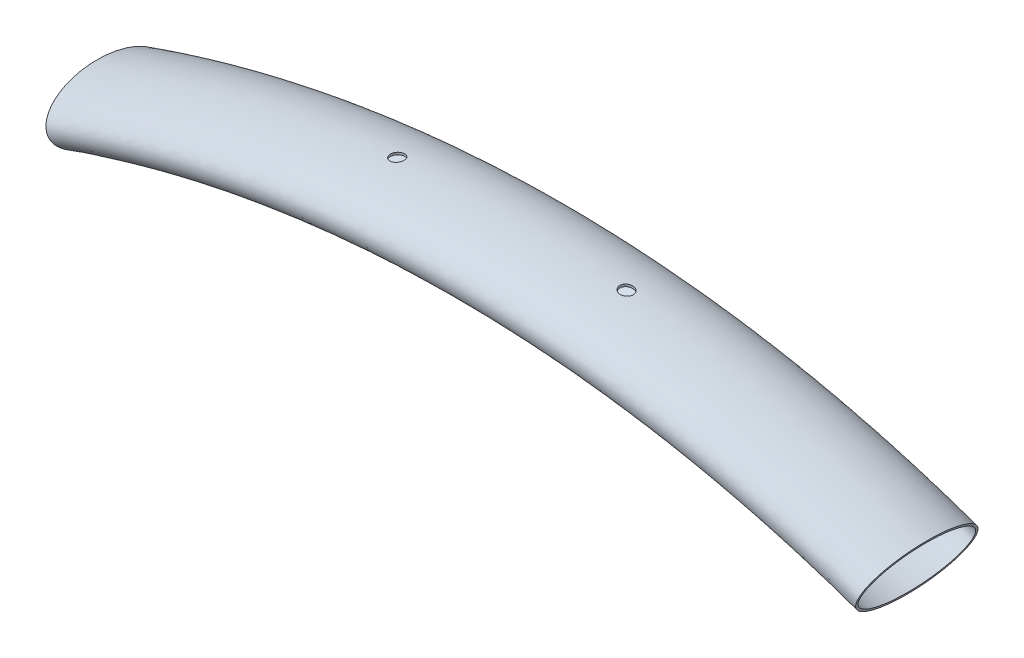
ISO-10303-21;
HEADER;
FILE_DESCRIPTION(('STEP AP214'),'2;1');
FILE_NAME('part.step','',(''),(''),'','','');
FILE_SCHEMA(('AUTOMOTIVE_DESIGN { 1 0 10303 214 1 1 1 1 }'));
ENDSEC;
DATA;
#1=APPLICATION_CONTEXT('core data for automotive mechanical design processes');
#2=APPLICATION_PROTOCOL_DEFINITION('international standard','automotive_design',2000,#1);
#3=PRODUCT_CONTEXT('',#1,'mechanical');
#4=PRODUCT('Part','Part','',(#3));
#5=PRODUCT_RELATED_PRODUCT_CATEGORY('part','',(#4));
#6=PRODUCT_DEFINITION_FORMATION('','',#4);
#7=PRODUCT_DEFINITION_CONTEXT('part definition',#1,'design');
#8=PRODUCT_DEFINITION('design','',#6,#7);
#9=PRODUCT_DEFINITION_SHAPE('','',#8);
#10=(LENGTH_UNIT() NAMED_UNIT(*) SI_UNIT(.MILLI.,.METRE.));
#11=(NAMED_UNIT(*) PLANE_ANGLE_UNIT() SI_UNIT($,.RADIAN.));
#12=(NAMED_UNIT(*) SI_UNIT($,.STERADIAN.) SOLID_ANGLE_UNIT());
#13=UNCERTAINTY_MEASURE_WITH_UNIT(LENGTH_MEASURE(1.E-05),#10,'distance_accuracy_value','');
#14=(GEOMETRIC_REPRESENTATION_CONTEXT(3) GLOBAL_UNCERTAINTY_ASSIGNED_CONTEXT((#13)) GLOBAL_UNIT_ASSIGNED_CONTEXT((#10,
#11,#12)) REPRESENTATION_CONTEXT('',''));
#15=CARTESIAN_POINT('',(0.,0.,0.));
#16=DIRECTION('',(0.,0.,1.));
#17=DIRECTION('',(1.,0.,0.));
#18=AXIS2_PLACEMENT_3D('',#15,#16,#17);
#19=CARTESIAN_POINT('',(16.6298249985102,1371.23970344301,-38.5));
#20=CARTESIAN_POINT('',(17.0007477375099,1370.18948603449,-38.5));
#21=CARTESIAN_POINT('',(17.7425932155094,1368.08905121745,-38.0679435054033));
#22=CARTESIAN_POINT('',(18.8672478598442,1364.90474418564,-36.0381168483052));
#23=CARTESIAN_POINT('',(19.948494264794,1361.84334169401,-32.5799915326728));
#24=CARTESIAN_POINT('',(21.2442337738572,1358.17463108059,-26.2099412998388));
#25=CARTESIAN_POINT('',(22.4502461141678,1354.75997077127,-15.4123334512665));
#26=CARTESIAN_POINT('',(22.9610834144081,1353.31360426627,0.));
#27=CARTESIAN_POINT('',(22.4502461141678,1354.75997077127,15.4123334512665));
#28=CARTESIAN_POINT('',(21.2442337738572,1358.17463108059,26.2099412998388));
#29=CARTESIAN_POINT('',(19.948494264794,1361.84334169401,32.5799915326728));
#30=CARTESIAN_POINT('',(18.8672478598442,1364.90474418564,36.0381168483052));
#31=CARTESIAN_POINT('',(17.7425932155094,1368.08905121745,38.0679435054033));
#32=CARTESIAN_POINT('',(16.6298249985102,1371.23970344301,38.7160282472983));
#33=CARTESIAN_POINT('',(15.5170567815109,1374.39035566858,38.0679435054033));
#34=CARTESIAN_POINT('',(14.3924021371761,1377.57466270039,36.0381168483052));
#35=CARTESIAN_POINT('',(13.3111557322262,1380.63606519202,32.5799915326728));
#36=CARTESIAN_POINT('',(12.015416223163,1384.30477580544,26.2099412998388));
#37=CARTESIAN_POINT('',(10.8094038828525,1387.71943611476,15.4123334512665));
#38=CARTESIAN_POINT('',(10.2985665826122,1389.16580261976,0.));
#39=CARTESIAN_POINT('',(10.8094038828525,1387.71943611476,-15.4123334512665));
#40=CARTESIAN_POINT('',(12.015416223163,1384.30477580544,-26.2099412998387));
#41=CARTESIAN_POINT('',(13.3111557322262,1380.63606519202,-32.5799915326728));
#42=CARTESIAN_POINT('',(14.3924021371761,1377.57466270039,-36.0381168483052));
#43=CARTESIAN_POINT('',(15.5170567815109,1374.39035566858,-38.0679435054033));
#44=CARTESIAN_POINT('',(16.2589022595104,1372.28992085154,-38.5));
#45=CARTESIAN_POINT('',(16.6298249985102,1371.23970344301,-38.5));
#46=B_SPLINE_CURVE_WITH_KNOTS('',3,(#19,#20,#21,#22,#23,#24,#25,#26,#27,#28,#29,#30,#31,#32,#33,
#34,#35,#36,#37,#38,#39,#40,#41,#42,#43,#44,#45),.UNSPECIFIED.,.T.,.F.,(4,1,1,1,1,1,1,1,1,1,1,1,
1,1,1,1,1,1,1,1,1,1,1,1,4),(0.,0.196349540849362,0.392699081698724,0.589048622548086,
0.785398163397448,1.17809724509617,1.5707963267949,1.96349540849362,2.35619449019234,
2.5525440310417,2.74889357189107,2.94524311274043,3.14159265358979,3.33794219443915,
3.53429173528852,3.73064127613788,3.92699081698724,4.31968989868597,4.71238898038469,
5.10508806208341,5.49778714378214,5.6941366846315,5.89048622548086,6.08683576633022,
6.28318530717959),.UNSPECIFIED.);
#47=CARTESIAN_POINT('',(283.383688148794,615.962333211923,0.));
#48=DIRECTION('',(0.,0.,-1.));
#49=AXIS1_PLACEMENT('',#47,#48);
#50=SURFACE_OF_REVOLUTION('',#46,#49);
#51=CARTESIAN_POINT('',(360.893181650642,1431.65807183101,-4.50000000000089));
#52=CARTESIAN_POINT('',(361.145822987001,1431.63406677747,-4.49998912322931));
#53=CARTESIAN_POINT('',(361.398744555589,1431.61116363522,-4.47865492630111));
#54=CARTESIAN_POINT('',(361.897842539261,1431.56814351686,-4.39373056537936));
#55=CARTESIAN_POINT('',(362.144011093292,1431.54802968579,-4.33009316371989));
#56=CARTESIAN_POINT('',(362.622306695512,1431.51091485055,-4.16224875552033));
#57=CARTESIAN_POINT('',(362.854437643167,1431.49391297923,-4.0580530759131));
#58=CARTESIAN_POINT('',(363.297956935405,1431.46308811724,-3.81200225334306));
#59=CARTESIAN_POINT('',(363.509350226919,1431.44926436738,-3.67015612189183));
#60=CARTESIAN_POINT('',(363.904787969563,1431.42469689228,-3.353244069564));
#61=CARTESIAN_POINT('',(364.088907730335,1431.41394460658,-3.17827278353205));
#62=CARTESIAN_POINT('',(364.425207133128,1431.39521204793,-2.79980039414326));
#63=CARTESIAN_POINT('',(364.577385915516,1431.38723184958,-2.59629852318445));
#64=CARTESIAN_POINT('',(364.845171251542,1431.37374146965,-2.16695073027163));
#65=CARTESIAN_POINT('',(364.960843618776,1431.3682268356,-1.94114599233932));
#66=CARTESIAN_POINT('',(365.152679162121,1431.35934402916,-1.47329612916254));
#67=CARTESIAN_POINT('',(365.228842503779,1431.35597584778,-1.23125107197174));
#68=CARTESIAN_POINT('',(365.339465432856,1431.35115530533,-0.737872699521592));
#69=CARTESIAN_POINT('',(365.373937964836,1431.34970234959,-0.486542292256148));
#70=CARTESIAN_POINT('',(365.400238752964,1431.34858942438,0.0183436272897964));
#71=CARTESIAN_POINT('',(365.392067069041,1431.3489294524,0.271899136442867));
#72=CARTESIAN_POINT('',(365.333311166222,1431.35143330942,0.774051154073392));
#73=CARTESIAN_POINT('',(365.282724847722,1431.35359722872,1.02264741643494));
#74=CARTESIAN_POINT('',(365.140581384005,1431.35991614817,1.50781041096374));
#75=CARTESIAN_POINT('',(365.049024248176,1431.36407114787,1.74437714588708));
#76=CARTESIAN_POINT('',(364.827561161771,1431.37463633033,2.19875691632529));
#77=CARTESIAN_POINT('',(364.697656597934,1431.38104643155,2.41657062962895));
#78=CARTESIAN_POINT('',(364.403218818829,1431.3964356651,2.82727457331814));
#79=CARTESIAN_POINT('',(364.238685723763,1431.40541478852,3.02016489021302));
#80=CARTESIAN_POINT('',(363.879697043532,1431.42624177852,3.37557818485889));
#81=CARTESIAN_POINT('',(363.685239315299,1431.4380898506,3.53809898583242));
#82=CARTESIAN_POINT('',(363.271989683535,1431.46486818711,3.8281855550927));
#83=CARTESIAN_POINT('',(363.0531977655,1431.47979845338,3.95575130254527));
#84=CARTESIAN_POINT('',(362.597299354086,1431.51281976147,4.17250004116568));
#85=CARTESIAN_POINT('',(362.360173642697,1431.53091414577,4.2616420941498));
#86=CARTESIAN_POINT('',(361.87457587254,1431.57010503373,4.398923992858));
#87=CARTESIAN_POINT('',(361.626103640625,1431.59120158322,4.44706321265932));
#88=CARTESIAN_POINT('',(361.124034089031,1431.6360776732,4.50118463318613));
#89=CARTESIAN_POINT('',(360.870422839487,1431.6598656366,4.50703054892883));
#90=CARTESIAN_POINT('',(360.366000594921,1431.7094189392,4.47615185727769));
#91=CARTESIAN_POINT('',(360.115189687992,1431.73518434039,4.43942591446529));
#92=CARTESIAN_POINT('',(359.622183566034,1431.78793226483,4.32422864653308));
#93=CARTESIAN_POINT('',(359.380035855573,1431.81492006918,4.24555639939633));
#94=CARTESIAN_POINT('',(358.912430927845,1431.86889876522,4.04857930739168));
#95=CARTESIAN_POINT('',(358.686974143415,1431.89588965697,3.93027343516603));
#96=CARTESIAN_POINT('',(358.2584919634,1431.94871769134,3.65693387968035));
#97=CARTESIAN_POINT('',(358.055530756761,1431.97455141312,3.50179887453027));
#98=CARTESIAN_POINT('',(357.678565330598,1432.02369153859,3.15928674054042));
#99=CARTESIAN_POINT('',(357.504560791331,1432.04699797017,2.97190996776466));
#100=CARTESIAN_POINT('',(357.191108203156,1432.0897589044,2.57083799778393));
#101=CARTESIAN_POINT('',(357.051544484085,1432.10922625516,2.35723460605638));
#102=CARTESIAN_POINT('',(356.810347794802,1432.14330669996,1.90923454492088));
#103=CARTESIAN_POINT('',(356.708712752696,1432.15792005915,1.67483901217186));
#104=CARTESIAN_POINT('',(356.547180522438,1432.18132314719,1.19414796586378));
#105=CARTESIAN_POINT('',(356.486918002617,1432.19016381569,0.947977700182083));
#106=CARTESIAN_POINT('',(356.408507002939,1432.20169448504,0.448881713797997));
#107=CARTESIAN_POINT('',(356.390356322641,1432.20438480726,0.195956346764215));
#108=CARTESIAN_POINT('',(356.396696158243,1432.2034483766,-0.307350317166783));
#109=CARTESIAN_POINT('',(356.420852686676,1432.19987110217,-0.557735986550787));
#110=CARTESIAN_POINT('',(356.510429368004,1432.18671803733,-1.05084603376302));
#111=CARTESIAN_POINT('',(356.575849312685,1432.1771422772,-1.29357045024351));
#112=CARTESIAN_POINT('',(356.745997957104,1432.15255843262,-1.76452836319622));
#113=CARTESIAN_POINT('',(356.850727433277,1432.13755024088,-1.9927615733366));
#114=CARTESIAN_POINT('',(357.096424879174,1432.10295677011,-2.42841146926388));
#115=CARTESIAN_POINT('',(357.237392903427,1432.0833714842,-2.63582812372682));
#116=CARTESIAN_POINT('',(357.552753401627,1432.04052298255,-3.02570448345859));
#117=CARTESIAN_POINT('',(357.727394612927,1432.01723263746,-3.20795996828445));
#118=CARTESIAN_POINT('',(358.104499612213,1431.96828928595,-3.54069160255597));
#119=CARTESIAN_POINT('',(358.306971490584,1431.94263559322,-3.69115847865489));
#120=CARTESIAN_POINT('',(358.736058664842,1431.88997020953,-3.95742287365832));
#121=CARTESIAN_POINT('',(358.962883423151,1431.86294800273,-4.07288045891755));
#122=CARTESIAN_POINT('',(359.432558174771,1431.80901456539,-4.26388451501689));
#123=CARTESIAN_POINT('',(359.675389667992,1431.78210324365,-4.33947618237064));
#124=CARTESIAN_POINT('',(360.081901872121,1431.73886101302,-4.42927261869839));
#125=CARTESIAN_POINT('',(360.242937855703,1431.72217840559,-4.45575470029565));
#126=CARTESIAN_POINT('',(360.567004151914,1431.68953463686,-4.4911219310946));
#127=CARTESIAN_POINT('',(360.730034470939,1431.67357347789,-4.50000702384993));
#128=CARTESIAN_POINT('',(360.893181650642,1431.65807183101,-4.50000000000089));
#129=B_SPLINE_CURVE_WITH_KNOTS('',3,(#51,#52,#53,#54,#55,#56,#57,#58,#59,#60,#61,#62,#63,#64,
#65,#66,#67,#68,#69,#70,#71,#72,#73,#74,#75,#76,#77,#78,#79,#80,#81,#82,#83,#84,#85,#86,#87,#88,
#89,#90,#91,#92,#93,#94,#95,#96,#97,#98,#99,#100,#101,#102,#103,#104,#105,#106,#107,#108,#109,
#110,#111,#112,#113,#114,#115,#116,#117,#118,#119,#120,#121,#122,#123,#124,#125,#126,#127,#128),
.UNSPECIFIED.,.T.,.F.,(4,2,2,2,2,2,2,2,2,2,2,2,2,2,2,2,2,2,2,2,2,2,2,2,2,2,2,2,2,2,2,2,2,2,2,2,
2,2,4),(0.,0.760743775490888,1.52233846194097,2.28372060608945,3.04492068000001,
3.80397804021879,4.56305582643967,5.32075722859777,6.07845545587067,6.83591836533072,
7.59338021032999,8.35087955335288,9.10837872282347,9.86585050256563,10.6233196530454,
11.3808430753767,12.1383669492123,12.896695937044,13.6550365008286,14.4158196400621,
15.1766266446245,15.9411110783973,16.7056153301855,17.4722477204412,18.2388716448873,
19.0028846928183,19.7668559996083,20.5239913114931,21.2810870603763,22.0322329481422,
22.783375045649,23.5345319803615,24.2856900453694,25.0426254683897,25.7997814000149,
26.564069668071,27.3274895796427,27.8187504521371,28.3100129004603),.UNSPECIFIED.);
#130=CARTESIAN_POINT('',(360.893181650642,1431.65807183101,-4.50000000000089));
#131=VERTEX_POINT('',#130);
#132=EDGE_CURVE('E46',#131,#131,#129,.T.);
#133=ORIENTED_EDGE('',*,*,#132,.F.);
#134=EDGE_LOOP('',(#133));
#135=FACE_BOUND('',#134,.T.);
#136=CARTESIAN_POINT('',(360.893181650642,1394.74533901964,-4.50000000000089));
#137=CARTESIAN_POINT('',(360.640762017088,1394.77045955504,-4.49998921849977));
#138=CARTESIAN_POINT('',(360.388036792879,1394.79423934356,-4.47869267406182));
#139=CARTESIAN_POINT('',(359.889271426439,1394.83852671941,-4.39389167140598));
#140=CARTESIAN_POINT('',(359.643238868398,1394.85903071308,-4.33034124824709));
#141=CARTESIAN_POINT('',(359.165151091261,1394.89648555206,-4.16269559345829));
#142=CARTESIAN_POINT('',(358.933092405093,1394.91343728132,-4.0586104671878));
#143=CARTESIAN_POINT('',(358.489672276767,1394.94381212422,-3.81279392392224));
#144=CARTESIAN_POINT('',(358.278306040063,1394.95723605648,-3.67107125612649));
#145=CARTESIAN_POINT('',(357.882940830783,1394.98077669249,-3.35445831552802));
#146=CARTESIAN_POINT('',(357.698859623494,1394.99090344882,-3.17967147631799));
#147=CARTESIAN_POINT('',(357.362587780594,1395.00830152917,-2.80159144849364));
#148=CARTESIAN_POINT('',(357.210398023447,1395.01557277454,-2.59829747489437));
#149=CARTESIAN_POINT('',(356.942484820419,1395.02770254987,-2.16929900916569));
#150=CARTESIAN_POINT('',(356.826709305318,1395.03256453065,-1.94362712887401));
#151=CARTESIAN_POINT('',(356.634636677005,1395.04031149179,-1.47603464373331));
#152=CARTESIAN_POINT('',(356.558339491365,1395.0431964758,-1.23411406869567));
#153=CARTESIAN_POINT('',(356.447393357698,1395.04730501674,-0.740861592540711));
#154=CARTESIAN_POINT('',(356.412749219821,1395.0485283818,-0.489528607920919));
#155=CARTESIAN_POINT('',(356.386112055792,1395.04947416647,0.0153900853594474));
#156=CARTESIAN_POINT('',(356.394119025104,1395.04919658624,0.268975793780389));
#157=CARTESIAN_POINT('',(356.452562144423,1395.04710086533,0.771256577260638));
#158=CARTESIAN_POINT('',(356.503007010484,1395.04528240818,1.01995063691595));
#159=CARTESIAN_POINT('',(356.644899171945,1395.03988053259,1.50533322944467));
#160=CARTESIAN_POINT('',(356.736346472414,1395.03629711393,1.74202176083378));
#161=CARTESIAN_POINT('',(356.957620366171,1395.02700342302,2.19664800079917));
#162=CARTESIAN_POINT('',(357.087443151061,1395.0212933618,2.41458756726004));
#163=CARTESIAN_POINT('',(357.381753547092,1395.00730526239,2.82555297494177));
#164=CARTESIAN_POINT('',(357.546240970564,1394.9990272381,3.01857895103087));
#165=CARTESIAN_POINT('',(357.905112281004,1394.97946617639,3.37420195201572));
#166=CARTESIAN_POINT('',(358.099488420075,1394.96818391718,3.53680683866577));
#167=CARTESIAN_POINT('',(358.512581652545,1394.94226406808,3.82707050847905));
#168=CARTESIAN_POINT('',(358.731298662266,1394.92762648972,3.95472941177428));
#169=CARTESIAN_POINT('',(359.186930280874,1394.8948123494,4.17161888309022));
#170=CARTESIAN_POINT('',(359.423855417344,1394.87663373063,4.26082701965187));
#171=CARTESIAN_POINT('',(359.909020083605,1394.83681496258,4.39829519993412));
#172=CARTESIAN_POINT('',(360.15725977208,1394.81517476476,4.44655466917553));
#173=CARTESIAN_POINT('',(360.658836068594,1394.76872061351,4.50099145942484));
#174=CARTESIAN_POINT('',(360.912186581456,1394.74389660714,4.5070319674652));
#175=CARTESIAN_POINT('',(361.416072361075,1394.6918034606,4.4766392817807));
#176=CARTESIAN_POINT('',(361.666607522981,1394.66453422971,4.44020451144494));
#177=CARTESIAN_POINT('',(362.159331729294,1394.60834764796,4.32564582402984));
#178=CARTESIAN_POINT('',(362.401463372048,1394.57942158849,4.24727926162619));
#179=CARTESIAN_POINT('',(362.869070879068,1394.52128784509,4.05094662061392));
#180=CARTESIAN_POINT('',(363.09454615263,1394.49208015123,3.93297913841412));
#181=CARTESIAN_POINT('',(363.523415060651,1394.43465449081,3.66015346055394));
#182=CARTESIAN_POINT('',(363.726714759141,1394.40644105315,3.50514658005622));
#183=CARTESIAN_POINT('',(364.104371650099,1394.35261165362,3.16278582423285));
#184=CARTESIAN_POINT('',(364.278729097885,1394.32699566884,2.97543223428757));
#185=CARTESIAN_POINT('',(364.592883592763,1394.27988896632,2.574274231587));
#186=CARTESIAN_POINT('',(364.732796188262,1394.25838451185,2.36056196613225));
#187=CARTESIAN_POINT('',(364.974645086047,1394.2206771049,1.91220338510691));
#188=CARTESIAN_POINT('',(365.076583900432,1394.20447380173,1.6775584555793));
#189=CARTESIAN_POINT('',(365.23848070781,1394.17852293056,1.1966825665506));
#190=CARTESIAN_POINT('',(365.298877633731,1394.16870792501,0.950603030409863));
#191=CARTESIAN_POINT('',(365.377577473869,1394.15588500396,0.451633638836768));
#192=CARTESIAN_POINT('',(365.395883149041,1394.15287664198,0.198744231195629));
#193=CARTESIAN_POINT('',(365.38986466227,1394.15386202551,-0.304026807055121));
#194=CARTESIAN_POINT('',(365.365955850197,1394.15778754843,-0.553913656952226));
#195=CARTESIAN_POINT('',(365.277047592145,1394.17225185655,-1.04606303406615));
#196=CARTESIAN_POINT('',(365.212048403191,1394.18279060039,-1.28832560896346));
#197=CARTESIAN_POINT('',(365.042925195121,1394.20982503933,-1.75841685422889));
#198=CARTESIAN_POINT('',(364.938801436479,1394.22632069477,-1.98624562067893));
#199=CARTESIAN_POINT('',(364.694497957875,1394.2642812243,-2.42120193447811));
#200=CARTESIAN_POINT('',(364.554317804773,1394.28574615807,-2.62832923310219));
#201=CARTESIAN_POINT('',(364.240404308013,1394.33264692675,-3.01816635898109));
#202=CARTESIAN_POINT('',(364.066362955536,1394.35811876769,-3.20062377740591));
#203=CARTESIAN_POINT('',(363.690468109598,1394.41149853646,-3.53387803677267));
#204=CARTESIAN_POINT('',(363.488606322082,1394.43940718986,-3.68466540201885));
#205=CARTESIAN_POINT('',(363.060314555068,1394.49655560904,-3.95196040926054));
#206=CARTESIAN_POINT('',(362.833633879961,1394.52580681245,-4.06806359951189));
#207=CARTESIAN_POINT('',(362.364095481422,1394.58393512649,-4.26035652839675));
#208=CARTESIAN_POINT('',(362.121256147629,1394.61281261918,-4.33659079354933));
#209=CARTESIAN_POINT('',(361.713059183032,1394.65913995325,-4.4277526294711));
#210=CARTESIAN_POINT('',(361.550359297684,1394.67704926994,-4.45480128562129));
#211=CARTESIAN_POINT('',(361.222876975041,1394.71194282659,-4.49092851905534));
#212=CARTESIAN_POINT('',(361.058094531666,1394.72892706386,-4.5000070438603));
#213=CARTESIAN_POINT('',(360.893181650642,1394.74533901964,-4.50000000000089));
#214=B_SPLINE_CURVE_WITH_KNOTS('',3,(#136,#137,#138,#139,#140,#141,#142,#143,#144,#145,#146,
#147,#148,#149,#150,#151,#152,#153,#154,#155,#156,#157,#158,#159,#160,#161,#162,#163,#164,#165,
#166,#167,#168,#169,#170,#171,#172,#173,#174,#175,#176,#177,#178,#179,#180,#181,#182,#183,#184,
#185,#186,#187,#188,#189,#190,#191,#192,#193,#194,#195,#196,#197,#198,#199,#200,#201,#202,#203,
#204,#205,#206,#207,#208,#209,#210,#211,#212,#213),.UNSPECIFIED.,.T.,.F.,(4,2,2,2,2,2,2,2,2,2,2,
2,2,2,2,2,2,2,2,2,2,2,2,2,2,2,2,2,2,2,2,2,2,2,2,2,2,2,4),(0.,0.760400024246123,1.52162858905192,
2.2826674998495,3.04352965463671,3.80204985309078,4.56059094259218,5.31804240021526,
6.07549246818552,6.83302999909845,7.59056744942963,8.34826052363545,9.1059536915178,
9.86357169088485,10.6211855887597,11.3786034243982,12.1360186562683,12.8938751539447,
13.6517422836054,14.4120641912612,15.1724143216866,15.9372126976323,16.7020381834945,
17.469987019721,18.2379290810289,19.0032587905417,19.768537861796,20.5256013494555,
21.282615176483,22.0322221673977,22.7818244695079,23.5314217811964,24.2810280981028,
25.0378019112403,25.7948018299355,26.5603123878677,27.3249661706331,27.8217555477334,
28.3185463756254),.UNSPECIFIED.);
#215=CARTESIAN_POINT('',(360.893181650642,1394.74533901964,-4.50000000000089));
#216=VERTEX_POINT('',#215);
#217=EDGE_CURVE('E84',#216,#216,#214,.T.);
#218=ORIENTED_EDGE('',*,*,#217,.F.);
#219=EDGE_LOOP('',(#218));
#220=FACE_BOUND('',#219,.T.);
#221=CARTESIAN_POINT('',(208.893181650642,1431.93930839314,-4.49999999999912));
#222=CARTESIAN_POINT('',(209.147299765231,1431.96250845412,-4.49998879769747));
#223=CARTESIAN_POINT('',(209.401498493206,1431.98685739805,-4.47840326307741));
#224=CARTESIAN_POINT('',(209.902686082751,1432.03705431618,-4.39268566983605));
#225=CARTESIAN_POINT('',(210.149665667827,1432.06290410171,-4.32850118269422));
#226=CARTESIAN_POINT('',(210.629107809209,1432.11505488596,-4.15945978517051));
#227=CARTESIAN_POINT('',(210.861578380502,1432.14135562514,-4.0546255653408));
#228=CARTESIAN_POINT('',(211.30551850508,1432.19323963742,-3.80725546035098));
#229=CARTESIAN_POINT('',(211.516993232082,1432.21882308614,-3.66472889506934));
#230=CARTESIAN_POINT('',(211.913182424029,1432.26804328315,-3.34579049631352));
#231=CARTESIAN_POINT('',(212.097875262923,1432.29167845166,-3.16935154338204));
#232=CARTESIAN_POINT('',(212.43497337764,1432.33572499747,-2.78757178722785));
#233=CARTESIAN_POINT('',(212.587378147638,1432.35613632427,-2.58223053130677));
#234=CARTESIAN_POINT('',(212.854700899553,1432.39248728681,-2.14957865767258));
#235=CARTESIAN_POINT('',(212.969810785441,1432.40844975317,-1.92238856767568));
#236=CARTESIAN_POINT('',(213.160185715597,1432.43510659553,-1.45159795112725));
#237=CARTESIAN_POINT('',(213.23545310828,1432.44580128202,-1.20799839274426));
#238=CARTESIAN_POINT('',(213.34336420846,1432.46120150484,-0.713656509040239));
#239=CARTESIAN_POINT('',(213.376385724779,1432.46596011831,-0.462998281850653));
#240=CARTESIAN_POINT('',(213.400047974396,1432.46936546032,0.0403468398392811));
#241=CARTESIAN_POINT('',(213.390690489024,1432.46801244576,0.29303364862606));
#242=CARTESIAN_POINT('',(213.33005455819,1432.45930673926,0.791781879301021));
#243=CARTESIAN_POINT('',(213.279009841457,1432.45198749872,1.03787235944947));
#244=CARTESIAN_POINT('',(213.136826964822,1432.43183666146,1.51794199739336));
#245=CARTESIAN_POINT('',(213.045688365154,1432.41900500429,1.7519210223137));
#246=CARTESIAN_POINT('',(212.825685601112,1432.3885348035,2.20188765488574));
#247=CARTESIAN_POINT('',(212.696715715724,1432.37088279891,2.41782263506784));
#248=CARTESIAN_POINT('',(212.404873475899,1432.33178021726,2.8250267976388));
#249=CARTESIAN_POINT('',(212.241999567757,1432.31032946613,3.01629484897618));
#250=CARTESIAN_POINT('',(211.885411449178,1432.26457628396,3.37049765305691));
#251=CARTESIAN_POINT('',(211.691443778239,1432.24025089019,3.53317427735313));
#252=CARTESIAN_POINT('',(211.279149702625,1432.19013395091,3.8237107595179));
#253=CARTESIAN_POINT('',(211.060822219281,1432.16434234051,3.95156907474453));
#254=CARTESIAN_POINT('',(210.604223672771,1432.11231151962,4.16975006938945));
#255=CARTESIAN_POINT('',(210.365819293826,1432.08607041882,4.25979342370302));
#256=CARTESIAN_POINT('',(209.877159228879,1432.03444637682,4.39844205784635));
#257=CARTESIAN_POINT('',(209.626903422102,1432.00906344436,4.44704691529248));
#258=CARTESIAN_POINT('',(209.121315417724,1431.96006516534,4.50140736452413));
#259=CARTESIAN_POINT('',(208.865977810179,1431.9364518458,4.50711453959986));
#260=CARTESIAN_POINT('',(208.357788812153,1431.89173070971,4.47528408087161));
#261=CARTESIAN_POINT('',(208.104937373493,1431.87062284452,4.4377472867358));
#262=CARTESIAN_POINT('',(207.609943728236,1431.83143152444,4.32061799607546));
#263=CARTESIAN_POINT('',(207.367764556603,1431.81333690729,4.24118547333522));
#264=CARTESIAN_POINT('',(206.900083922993,1431.78026005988,4.04253672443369));
#265=CARTESIAN_POINT('',(206.674582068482,1431.76527775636,3.92332143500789));
#266=CARTESIAN_POINT('',(206.247716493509,1431.73844422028,3.64905437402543));
#267=CARTESIAN_POINT('',(206.046252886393,1431.72657976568,3.49415933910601));
#268=CARTESIAN_POINT('',(205.672144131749,1431.70569077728,3.15262824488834));
#269=CARTESIAN_POINT('',(205.499498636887,1431.69666620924,2.96599256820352));
#270=CARTESIAN_POINT('',(205.188346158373,1431.68116778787,2.56673147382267));
#271=CARTESIAN_POINT('',(205.049764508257,1431.67468833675,2.35416445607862));
#272=CARTESIAN_POINT('',(204.810214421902,1431.66391970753,1.90874896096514));
#273=CARTESIAN_POINT('',(204.709245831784,1431.65963052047,1.67590056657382));
#274=CARTESIAN_POINT('',(204.54784695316,1431.65295137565,1.19664960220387));
#275=CARTESIAN_POINT('',(204.487397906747,1431.65056053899,0.950253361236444));
#276=CARTESIAN_POINT('',(204.408687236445,1431.64747534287,0.450801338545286));
#277=CARTESIAN_POINT('',(204.390425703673,1431.64678098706,0.197745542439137));
#278=CARTESIAN_POINT('',(204.396611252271,1431.64701930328,-0.307860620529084));
#279=CARTESIAN_POINT('',(204.421061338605,1431.64795208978,-0.560410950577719));
#280=CARTESIAN_POINT('',(204.511978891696,1431.65153635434,-1.05781975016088));
#281=CARTESIAN_POINT('',(204.578446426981,1431.65418783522,-1.30267820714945));
#282=CARTESIAN_POINT('',(204.751503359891,1431.66142471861,-1.77775528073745));
#283=CARTESIAN_POINT('',(204.85809346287,1431.66601015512,-2.00797363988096));
#284=CARTESIAN_POINT('',(205.108343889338,1431.67741660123,-2.44722087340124));
#285=CARTESIAN_POINT('',(205.252002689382,1431.68423751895,-2.65625061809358));
#286=CARTESIAN_POINT('',(205.572247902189,1431.70044516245,-3.04716823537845));
#287=CARTESIAN_POINT('',(205.748828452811,1431.70983143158,-3.22906092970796));
#288=CARTESIAN_POINT('',(206.129927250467,1431.73146773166,-3.56064984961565));
#289=CARTESIAN_POINT('',(206.334452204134,1431.74371845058,-3.71033832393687));
#290=CARTESIAN_POINT('',(206.765712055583,1431.77127744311,-3.97338073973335));
#291=CARTESIAN_POINT('',(206.992467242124,1431.7865885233,-4.0867010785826));
#292=CARTESIAN_POINT('',(207.461380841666,1431.8202641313,-4.27358256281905));
#293=CARTESIAN_POINT('',(207.703520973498,1431.83862507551,-4.34718994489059));
#294=CARTESIAN_POINT('',(208.104831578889,1431.87083204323,-4.43324945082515));
#295=CARTESIAN_POINT('',(208.261490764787,1431.88382921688,-4.45825637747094));
#296=CARTESIAN_POINT('',(208.576483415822,1431.91083832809,-4.49163513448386));
#297=CARTESIAN_POINT('',(208.734816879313,1431.92485026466,-4.50000698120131));
#298=CARTESIAN_POINT('',(208.893181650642,1431.93930839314,-4.49999999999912));
#299=B_SPLINE_CURVE_WITH_KNOTS('',3,(#221,#222,#223,#224,#225,#226,#227,#228,#229,#230,#231,
#232,#233,#234,#235,#236,#237,#238,#239,#240,#241,#242,#243,#244,#245,#246,#247,#248,#249,#250,
#251,#252,#253,#254,#255,#256,#257,#258,#259,#260,#261,#262,#263,#264,#265,#266,#267,#268,#269,
#270,#271,#272,#273,#274,#275,#276,#277,#278,#279,#280,#281,#282,#283,#284,#285,#286,#287,#288,
#289,#290,#291,#292,#293,#294,#295,#296,#297,#298),.UNSPECIFIED.,.T.,.F.,(4,2,2,2,2,2,2,2,2,2,2,
2,2,2,2,2,2,2,2,2,2,2,2,2,2,2,2,2,2,2,2,2,2,2,2,2,2,2,4),(0.,0.764942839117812,1.53082887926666,
2.29628801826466,3.06155806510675,3.8274426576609,4.59333924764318,5.35522984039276,
6.11707552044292,6.87205919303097,7.62701113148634,8.37775908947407,9.12851528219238,
9.88138981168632,10.6342988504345,11.3936904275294,12.1531156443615,12.9180557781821,
13.6830037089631,14.4488148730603,15.2146111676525,15.9775043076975,16.7403794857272,
17.4999652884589,18.2595419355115,19.017438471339,19.7753319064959,20.5328742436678,
21.2904182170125,22.0480154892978,22.80561399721,23.5632258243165,24.3208065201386,
25.0782524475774,25.8358804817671,26.5942065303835,27.3516477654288,27.8283556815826,
28.3050631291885),.UNSPECIFIED.);
#300=CARTESIAN_POINT('',(208.893181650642,1431.93930839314,-4.49999999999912));
#301=VERTEX_POINT('',#300);
#302=EDGE_CURVE('E70',#301,#301,#299,.T.);
#303=ORIENTED_EDGE('',*,*,#302,.F.);
#304=EDGE_LOOP('',(#303));
#305=FACE_BOUND('',#304,.T.);
#306=CARTESIAN_POINT('',(208.893181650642,1395.03990069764,-4.49999999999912));
#307=CARTESIAN_POINT('',(208.63887108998,1395.01558313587,-4.49998879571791));
#308=CARTESIAN_POINT('',(208.384509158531,1394.98986940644,-4.47837048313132));
#309=CARTESIAN_POINT('',(207.883062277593,1394.93650901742,-4.39255232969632));
#310=CARTESIAN_POINT('',(207.6359867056,1394.9088600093,-4.32829992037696));
#311=CARTESIAN_POINT('',(207.15641861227,1394.85279186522,-4.15911521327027));
#312=CARTESIAN_POINT('',(206.923917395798,1394.82437320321,-4.0542074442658));
#313=CARTESIAN_POINT('',(206.479942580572,1394.76808390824,-3.80668719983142));
#314=CARTESIAN_POINT('',(206.268463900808,1394.74021314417,-3.66408386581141));
#315=CARTESIAN_POINT('',(205.872130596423,1394.68640547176,-3.34486004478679));
#316=CARTESIAN_POINT('',(205.687316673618,1394.66047154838,-3.1681884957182));
#317=CARTESIAN_POINT('',(205.350024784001,1394.61203215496,-2.78586089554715));
#318=CARTESIAN_POINT('',(205.197547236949,1394.58952672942,-2.58020446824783));
#319=CARTESIAN_POINT('',(204.930235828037,1394.54940267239,-2.14696709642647));
#320=CARTESIAN_POINT('',(204.815187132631,1394.53175624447,-1.91952133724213));
#321=CARTESIAN_POINT('',(204.62499759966,1394.50227213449,-1.44816381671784));
#322=CARTESIAN_POINT('',(204.549853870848,1394.49043403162,-1.20425324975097));
#323=CARTESIAN_POINT('',(204.442391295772,1394.47342400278,-0.709772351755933));
#324=CARTESIAN_POINT('',(204.409609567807,1394.46818004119,-0.45930505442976));
#325=CARTESIAN_POINT('',(204.386358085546,1394.46446601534,0.0436295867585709));
#326=CARTESIAN_POINT('',(204.395886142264,1394.46599560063,0.296096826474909));
#327=CARTESIAN_POINT('',(204.456740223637,1394.47569041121,0.794016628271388));
#328=CARTESIAN_POINT('',(204.507775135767,1394.4838094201,1.03950576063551));
#329=CARTESIAN_POINT('',(204.64972641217,1394.50610602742,1.518373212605));
#330=CARTESIAN_POINT('',(204.740643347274,1394.52028371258,1.75175135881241));
#331=CARTESIAN_POINT('',(204.960059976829,1394.55388863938,2.20072932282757));
#332=CARTESIAN_POINT('',(205.088692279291,1394.57333438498,2.41626291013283));
#333=CARTESIAN_POINT('',(205.379692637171,1394.61630531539,2.82274390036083));
#334=CARTESIAN_POINT('',(205.542062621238,1394.63983073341,3.01368989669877));
#335=CARTESIAN_POINT('',(205.897864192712,1394.68991393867,3.36774810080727));
#336=CARTESIAN_POINT('',(206.091608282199,1394.71650136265,3.53054209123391));
#337=CARTESIAN_POINT('',(206.503463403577,1394.77108656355,3.82136183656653));
#338=CARTESIAN_POINT('',(206.721575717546,1394.79908441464,3.94938576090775));
#339=CARTESIAN_POINT('',(207.178082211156,1394.85535958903,4.16809696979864));
#340=CARTESIAN_POINT('',(207.416633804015,1394.88363725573,4.25845579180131));
#341=CARTESIAN_POINT('',(207.905693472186,1394.93897072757,4.39767073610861));
#342=CARTESIAN_POINT('',(208.156201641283,1394.96602652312,4.44652653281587));
#343=CARTESIAN_POINT('',(208.662268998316,1395.01789859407,4.50127676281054));
#344=CARTESIAN_POINT('',(208.917831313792,1395.04271342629,4.50714370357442));
#345=CARTESIAN_POINT('',(209.426541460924,1395.08933379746,4.475541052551));
#346=CARTESIAN_POINT('',(209.679689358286,1395.11113941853,4.43807264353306));
#347=CARTESIAN_POINT('',(210.174979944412,1395.15120669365,4.3210432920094));
#348=CARTESIAN_POINT('',(210.417172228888,1395.1694858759,4.2416982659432));
#349=CARTESIAN_POINT('',(210.884916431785,1395.2025186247,4.04320820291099));
#350=CARTESIAN_POINT('',(211.110468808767,1395.21727228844,3.92406426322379));
#351=CARTESIAN_POINT('',(211.53730655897,1395.24333564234,3.65001484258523));
#352=CARTESIAN_POINT('',(211.738707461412,1395.25466215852,3.49529086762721));
#353=CARTESIAN_POINT('',(212.112738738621,1395.27430947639,3.15412786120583));
#354=CARTESIAN_POINT('',(212.285369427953,1395.28263031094,2.96768917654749));
#355=CARTESIAN_POINT('',(212.596580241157,1395.29670030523,2.56879475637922));
#356=CARTESIAN_POINT('',(212.735227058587,1395.30245452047,2.35639122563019));
#357=CARTESIAN_POINT('',(212.974947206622,1395.31187945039,1.91130368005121));
#358=CARTESIAN_POINT('',(213.076020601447,1395.31555016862,1.67861969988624));
#359=CARTESIAN_POINT('',(213.237709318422,1395.3212073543,1.19957740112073));
#360=CARTESIAN_POINT('',(213.298324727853,1395.32319382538,0.953219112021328));
#361=CARTESIAN_POINT('',(213.377371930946,1395.32575055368,0.453817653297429));
#362=CARTESIAN_POINT('',(213.395803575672,1395.32632080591,0.200774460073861));
#363=CARTESIAN_POINT('',(213.389957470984,1395.32613646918,-0.304890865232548));
#364=CARTESIAN_POINT('',(213.365667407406,1395.32538149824,-0.557512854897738));
#365=CARTESIAN_POINT('',(213.275045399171,1395.32242699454,-1.05509213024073));
#366=CARTESIAN_POINT('',(213.208713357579,1395.32022745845,-1.3000493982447));
#367=CARTESIAN_POINT('',(213.035896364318,1395.31409470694,-1.77534772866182));
#368=CARTESIAN_POINT('',(212.929410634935,1395.31016145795,-2.00568850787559));
#369=CARTESIAN_POINT('',(212.679332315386,1395.30014826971,-2.44519641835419));
#370=CARTESIAN_POINT('',(212.535741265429,1395.29406841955,-2.65436442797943));
#371=CARTESIAN_POINT('',(212.215628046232,1395.27929817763,-3.0455207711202));
#372=CARTESIAN_POINT('',(212.039118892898,1395.27060881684,-3.22751979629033));
#373=CARTESIAN_POINT('',(211.658142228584,1395.25017980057,-3.55932681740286));
#374=CARTESIAN_POINT('',(211.453668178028,1395.23843943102,-3.70912726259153));
#375=CARTESIAN_POINT('',(211.022601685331,1395.21159088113,-3.9723294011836));
#376=CARTESIAN_POINT('',(210.795999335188,1395.19648118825,-4.08571469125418));
#377=CARTESIAN_POINT('',(210.327409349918,1395.16279158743,-4.27276174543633));
#378=CARTESIAN_POINT('',(210.08543984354,1395.14421572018,-4.34646937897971));
#379=CARTESIAN_POINT('',(209.683850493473,1395.11122554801,-4.43285421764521));
#380=CARTESIAN_POINT('',(209.526722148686,1395.09779815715,-4.45801079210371));
#381=CARTESIAN_POINT('',(209.210796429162,1395.06972891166,-4.49158716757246));
#382=CARTESIAN_POINT('',(209.05199905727,1395.0550870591,-4.50000699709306));
#383=CARTESIAN_POINT('',(208.893181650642,1395.03990069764,-4.49999999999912));
#384=B_SPLINE_CURVE_WITH_KNOTS('',3,(#306,#307,#308,#309,#310,#311,#312,#313,#314,#315,#316,
#317,#318,#319,#320,#321,#322,#323,#324,#325,#326,#327,#328,#329,#330,#331,#332,#333,#334,#335,
#336,#337,#338,#339,#340,#341,#342,#343,#344,#345,#346,#347,#348,#349,#350,#351,#352,#353,#354,
#355,#356,#357,#358,#359,#360,#361,#362,#363,#364,#365,#366,#367,#368,#369,#370,#371,#372,#373,
#374,#375,#376,#377,#378,#379,#380,#381,#382,#383),.UNSPECIFIED.,.T.,.F.,(4,2,2,2,2,2,2,2,2,2,2,
2,2,2,2,2,2,2,2,2,2,2,2,2,2,2,2,2,2,2,2,2,2,2,2,2,2,2,4),(0.,0.765827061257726,1.53260015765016,
2.29891135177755,3.06503688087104,3.83231974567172,4.59961257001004,5.36242023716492,
6.12517262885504,6.87951806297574,7.63382446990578,8.38288563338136,9.13195751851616,
9.88369540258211,10.635476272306,11.3952666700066,12.1550970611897,12.9214216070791,
13.6877521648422,14.45457276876,15.2213724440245,15.9842565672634,16.7471196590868,
17.5061742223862,18.2652204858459,19.0227649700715,19.7803081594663,20.5378497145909,
21.2953939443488,22.0531565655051,22.8109209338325,23.5686999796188,24.326447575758,
25.0838961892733,25.8415222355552,26.5994890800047,27.3565777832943,27.8348389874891,
28.3130993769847),.UNSPECIFIED.);
#385=CARTESIAN_POINT('',(208.893181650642,1395.03990069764,-4.49999999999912));
#386=VERTEX_POINT('',#385);
#387=EDGE_CURVE('E65',#386,#386,#384,.T.);
#388=ORIENTED_EDGE('',*,*,#387,.F.);
#389=EDGE_LOOP('',(#388));
#390=FACE_BOUND('',#389,.T.);
#391=CARTESIAN_POINT('',(16.6298249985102,1371.23970344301,-38.5));
#392=VERTEX_POINT('',#391);
#393=EDGE_CURVE('E27',#392,#392,#46,.T.);
#394=ORIENTED_EDGE('',*,*,#393,.T.);
#395=EDGE_LOOP('',(#394));
#396=FACE_BOUND('',#395,.T.);
#397=CARTESIAN_POINT('',(553.232720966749,1370.13938734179,-38.5));
#398=CARTESIAN_POINT('',(552.857494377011,1369.09069992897,-38.5));
#399=CARTESIAN_POINT('',(552.107041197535,1366.99332510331,-38.0679435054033));
#400=CARTESIAN_POINT('',(550.969337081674,1363.81365708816,-36.0381168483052));
#401=CARTESIAN_POINT('',(549.875544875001,1360.75671456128,-32.5799915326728));
#402=CARTESIAN_POINT('',(548.564770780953,1357.09334866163,-26.2099412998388));
#403=CARTESIAN_POINT('',(547.344764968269,1353.68366295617,-15.4123334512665));
#404=CARTESIAN_POINT('',(546.828000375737,1352.23940357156,0.));
#405=CARTESIAN_POINT('',(547.344764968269,1353.68366295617,15.4123334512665));
#406=CARTESIAN_POINT('',(548.564770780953,1357.09334866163,26.2099412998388));
#407=CARTESIAN_POINT('',(549.875544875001,1360.75671456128,32.5799915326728));
#408=CARTESIAN_POINT('',(550.969337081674,1363.81365708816,36.0381168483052));
#409=CARTESIAN_POINT('',(552.107041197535,1366.99332510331,38.0679435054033));
#410=CARTESIAN_POINT('',(553.232720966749,1370.13938734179,38.7160282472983));
#411=CARTESIAN_POINT('',(554.358400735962,1373.28544958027,38.0679435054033));
#412=CARTESIAN_POINT('',(555.496104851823,1376.46511759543,36.0381168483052));
#413=CARTESIAN_POINT('',(556.589897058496,1379.52206012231,32.5799915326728));
#414=CARTESIAN_POINT('',(557.900671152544,1383.18542602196,26.2099412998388));
#415=CARTESIAN_POINT('',(559.120676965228,1386.59511172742,15.4123334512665));
#416=CARTESIAN_POINT('',(559.637441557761,1388.03937111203,0.));
#417=CARTESIAN_POINT('',(559.120676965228,1386.59511172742,-15.4123334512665));
#418=CARTESIAN_POINT('',(557.900671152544,1383.18542602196,-26.2099412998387));
#419=CARTESIAN_POINT('',(556.589897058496,1379.52206012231,-32.5799915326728));
#420=CARTESIAN_POINT('',(555.496104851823,1376.46511759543,-36.0381168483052));
#421=CARTESIAN_POINT('',(554.358400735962,1373.28544958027,-38.0679435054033));
#422=CARTESIAN_POINT('',(553.607947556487,1371.18807475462,-38.5));
#423=CARTESIAN_POINT('',(553.232720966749,1370.13938734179,-38.5));
#424=B_SPLINE_CURVE_WITH_KNOTS('',3,(#397,#398,#399,#400,#401,#402,#403,#404,#405,#406,#407,
#408,#409,#410,#411,#412,#413,#414,#415,#416,#417,#418,#419,#420,#421,#422,#423),.UNSPECIFIED.,
.T.,.F.,(4,1,1,1,1,1,1,1,1,1,1,1,1,1,1,1,1,1,1,1,1,1,1,1,4),(0.,0.196349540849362,
0.392699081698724,0.589048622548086,0.785398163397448,1.17809724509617,1.5707963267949,
1.96349540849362,2.35619449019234,2.5525440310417,2.74889357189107,2.94524311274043,
3.14159265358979,3.33794219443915,3.53429173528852,3.73064127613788,3.92699081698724,
4.31968989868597,4.71238898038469,5.10508806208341,5.49778714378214,5.6941366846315,
5.89048622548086,6.08683576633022,6.28318530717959),.UNSPECIFIED.);
#425=CARTESIAN_POINT('',(553.232720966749,1370.13938734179,-38.5));
#426=VERTEX_POINT('',#425);
#427=EDGE_CURVE('E125',#426,#426,#424,.T.);
#428=ORIENTED_EDGE('',*,*,#427,.F.);
#429=EDGE_LOOP('',(#428));
#430=FACE_BOUND('',#429,.T.);
#431=ADVANCED_FACE('F14',(#135,#220,#305,#390,#396,#430),#50,.F.);
#432=CARTESIAN_POINT('',(16.6298249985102,1371.23970344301,0.));
#433=DIRECTION('',(-0.942917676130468,-0.333025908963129,0.));
#434=DIRECTION('',(0.,0.,-1.));
#435=AXIS2_PLACEMENT_3D('',#432,#433,#434);
#436=ELLIPSE('',#435,40.,20.);
#437=CARTESIAN_POINT('',(283.383688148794,615.962333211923,0.));
#438=DIRECTION('',(0.,0.,-1.));
#439=AXIS1_PLACEMENT('',#437,#438);
#440=SURFACE_OF_REVOLUTION('',#436,#439);
#441=CARTESIAN_POINT('',(360.893181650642,1433.16815783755,-4.50000000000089));
#442=CARTESIAN_POINT('',(361.145851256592,1433.14419443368,-4.49998911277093));
#443=CARTESIAN_POINT('',(361.398798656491,1433.12130518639,-4.47865012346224));
#444=CARTESIAN_POINT('',(361.897942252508,1433.07825814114,-4.39370918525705));
#445=CARTESIAN_POINT('',(362.144130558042,1433.05810343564,-4.33005985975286));
#446=CARTESIAN_POINT('',(362.622458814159,1433.02085799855,-4.16218675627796));
#447=CARTESIAN_POINT('',(362.854602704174,1433.0037664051,-4.05797441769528));
#448=CARTESIAN_POINT('',(363.29814225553,1432.97272364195,-3.81188652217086));
#449=CARTESIAN_POINT('',(363.509542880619,1432.9587717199,-3.6700200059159));
#450=CARTESIAN_POINT('',(363.904993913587,1432.93392412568,-3.35306077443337));
#451=CARTESIAN_POINT('',(364.089119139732,1432.92302001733,-3.17806206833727));
#452=CARTESIAN_POINT('',(364.4254225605,1432.90397785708,-2.79953071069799));
#453=CARTESIAN_POINT('',(364.57759989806,1432.89583987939,-2.59599729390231));
#454=CARTESIAN_POINT('',(364.845366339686,1432.88204858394,-2.16659609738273));
#455=CARTESIAN_POINT('',(364.961023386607,1432.87639064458,-1.94077082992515));
#456=CARTESIAN_POINT('',(365.152823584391,1432.86725567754,-1.47288054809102));
#457=CARTESIAN_POINT('',(365.228966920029,1432.86377863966,-1.2308156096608));
#458=CARTESIAN_POINT('',(365.339540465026,1432.85879390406,-0.737418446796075));
#459=CARTESIAN_POINT('',(365.373986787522,1432.85728544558,-0.486089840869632));
#460=CARTESIAN_POINT('',(365.400236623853,1432.8561322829,0.018788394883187));
#461=CARTESIAN_POINT('',(365.392040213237,1432.85648757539,0.27233802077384));
#462=CARTESIAN_POINT('',(365.333238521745,1432.85908684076,0.774462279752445));
#463=CARTESIAN_POINT('',(365.282633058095,1432.86133082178,1.02303689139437));
#464=CARTESIAN_POINT('',(365.140458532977,1432.86785589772,1.5081534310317));
#465=CARTESIAN_POINT('',(365.04888947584,1432.87213699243,1.74469536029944));
#466=CARTESIAN_POINT('',(364.82740813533,1432.88298071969,2.19902913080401));
#467=CARTESIAN_POINT('',(364.697496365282,1432.8895433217,2.41682122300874));
#468=CARTESIAN_POINT('',(364.403051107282,1432.9052431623,2.82748139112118));
#469=CARTESIAN_POINT('',(364.238517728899,1432.91438039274,3.02034954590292));
#470=CARTESIAN_POINT('',(363.879522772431,1432.93551065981,3.37573236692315));
#471=CARTESIAN_POINT('',(363.685057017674,1432.94750409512,3.5382427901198));
#472=CARTESIAN_POINT('',(363.271793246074,1432.97454326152,3.82830759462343));
#473=CARTESIAN_POINT('',(363.052995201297,1432.98958899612,3.95586193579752));
#474=CARTESIAN_POINT('',(362.59706801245,1433.0227996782,4.17259567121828));
#475=CARTESIAN_POINT('',(362.359918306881,1433.04096815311,4.26173126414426));
#476=CARTESIAN_POINT('',(361.874269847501,1433.08025592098,4.3989935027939));
#477=CARTESIAN_POINT('',(361.625770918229,1433.10137525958,4.44711951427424));
#478=CARTESIAN_POINT('',(361.123642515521,1433.14624172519,4.50120631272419));
#479=CARTESIAN_POINT('',(360.869999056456,1433.16999712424,4.50703032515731));
#480=CARTESIAN_POINT('',(360.365511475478,1433.21943015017,4.47609614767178));
#481=CARTESIAN_POINT('',(360.114667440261,1433.2451078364,4.43933664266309));
#482=CARTESIAN_POINT('',(359.621621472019,1433.29762725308,4.32406431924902));
#483=CARTESIAN_POINT('',(359.379466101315,1433.32447392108,4.24535455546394));
#484=CARTESIAN_POINT('',(358.911850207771,1433.37812947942,4.04829642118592));
#485=CARTESIAN_POINT('',(358.6863901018,1433.4049383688,3.92994706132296));
#486=CARTESIAN_POINT('',(358.257940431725,1433.45737098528,3.65653559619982));
#487=CARTESIAN_POINT('',(358.055011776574,1433.48299139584,3.50137737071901));
#488=CARTESIAN_POINT('',(357.678114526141,1433.53169592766,3.15882696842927));
#489=CARTESIAN_POINT('',(357.504145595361,1433.5547800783,2.97143516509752));
#490=CARTESIAN_POINT('',(357.190772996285,1433.59710826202,2.57035269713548));
#491=CARTESIAN_POINT('',(357.051252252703,1433.61636525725,2.35675490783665));
#492=CARTESIAN_POINT('',(356.810137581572,1433.6500600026,1.9087808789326));
#493=CARTESIAN_POINT('',(356.708541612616,1433.66449801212,1.67440575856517));
#494=CARTESIAN_POINT('',(356.547066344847,1433.68761125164,1.19373270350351));
#495=CARTESIAN_POINT('',(356.486827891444,1433.69633606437,0.947557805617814));
#496=CARTESIAN_POINT('',(356.408464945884,1433.70770996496,0.448460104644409));
#497=CARTESIAN_POINT('',(356.390338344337,1433.71035935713,0.195537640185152));
#498=CARTESIAN_POINT('',(356.396725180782,1433.70942856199,-0.307819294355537));
#499=CARTESIAN_POINT('',(356.420914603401,1433.70589571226,-0.558258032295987));
#500=CARTESIAN_POINT('',(356.510575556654,1433.69290001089,-1.05146916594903));
#501=CARTESIAN_POINT('',(356.576046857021,1433.68343719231,-1.29424160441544));
#502=CARTESIAN_POINT('',(356.746317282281,1433.65912924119,-1.76528747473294));
#503=CARTESIAN_POINT('',(356.85111721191,1433.64428399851,-1.99356060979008));
#504=CARTESIAN_POINT('',(357.096973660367,1433.61004594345,-2.42927618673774));
#505=CARTESIAN_POINT('',(357.238030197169,1433.59065312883,-2.6367186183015));
#506=CARTESIAN_POINT('',(357.553546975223,1433.54820553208,-3.02658170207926));
#507=CARTESIAN_POINT('',(357.728248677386,1433.52512449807,-3.20880404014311));
#508=CARTESIAN_POINT('',(358.105471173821,1433.47659193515,-3.5414578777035));
#509=CARTESIAN_POINT('',(358.308000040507,1433.45113971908,-3.69188012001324));
#510=CARTESIAN_POINT('',(358.737160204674,1433.3988586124,-3.9580218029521));
#511=CARTESIAN_POINT('',(358.963997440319,1433.37201915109,-4.07340678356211));
#512=CARTESIAN_POINT('',(359.433679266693,1433.31841212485,-4.26426695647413));
#513=CARTESIAN_POINT('',(359.676505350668,1433.29164451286,-4.33978740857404));
#514=CARTESIAN_POINT('',(360.082830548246,1433.24861519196,-4.42943580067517));
#515=CARTESIAN_POINT('',(360.243686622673,1433.23201573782,-4.45585703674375));
#516=CARTESIAN_POINT('',(360.567383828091,1433.19951453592,-4.49114267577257));
#517=CARTESIAN_POINT('',(360.730224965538,1433.18361279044,-4.5000070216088));
#518=CARTESIAN_POINT('',(360.893181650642,1433.16815783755,-4.50000000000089));
#519=B_SPLINE_CURVE_WITH_KNOTS('',3,(#441,#442,#443,#444,#445,#446,#447,#448,#449,#450,#451,
#452,#453,#454,#455,#456,#457,#458,#459,#460,#461,#462,#463,#464,#465,#466,#467,#468,#469,#470,
#471,#472,#473,#474,#475,#476,#477,#478,#479,#480,#481,#482,#483,#484,#485,#486,#487,#488,#489,
#490,#491,#492,#493,#494,#495,#496,#497,#498,#499,#500,#501,#502,#503,#504,#505,#506,#507,#508,
#509,#510,#511,#512,#513,#514,#515,#516,#517,#518),.UNSPECIFIED.,.T.,.F.,(4,2,2,2,2,2,2,2,2,2,2,
2,2,2,2,2,2,2,2,2,2,2,2,2,2,2,2,2,2,2,2,2,2,2,2,2,2,2,4),(0.,0.760817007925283,1.52248737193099,
2.28394308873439,3.04521614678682,3.80436069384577,4.56352560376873,5.32126971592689,
6.07901028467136,6.83645794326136,7.59390425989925,8.35135384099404,9.10880334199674,
9.86624270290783,10.6236796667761,11.3812224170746,12.1387660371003,12.8971710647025,
13.6555878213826,14.416455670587,15.1773470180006,15.9418424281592,16.7063569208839,
17.4728902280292,18.2394146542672,19.0032969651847,19.7671381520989,20.5242591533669,
21.2813422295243,22.0326536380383,22.7839608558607,23.5352834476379,24.2866064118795,
25.0435371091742,25.8006878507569,26.5648541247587,27.3281509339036,27.8188305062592,
28.3095116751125),.UNSPECIFIED.);
#520=CARTESIAN_POINT('',(360.893181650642,1433.16815783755,-4.50000000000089));
#521=VERTEX_POINT('',#520);
#522=EDGE_CURVE('E20',#521,#521,#519,.T.);
#523=ORIENTED_EDGE('',*,*,#522,.T.);
#524=EDGE_LOOP('',(#523));
#525=FACE_BOUND('',#524,.T.);
#526=CARTESIAN_POINT('',(360.893181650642,1393.23457059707,-4.50000000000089));
#527=CARTESIAN_POINT('',(360.640727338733,1393.25974344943,-4.49998920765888));
#528=CARTESIAN_POINT('',(360.387969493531,1393.28360321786,-4.47868680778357));
#529=CARTESIAN_POINT('',(359.889144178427,1393.32810241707,-4.39386444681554));
#530=CARTESIAN_POINT('',(359.643084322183,1393.34873829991,-4.33029837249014));
#531=CARTESIAN_POINT('',(359.164948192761,1393.38650028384,-4.16261312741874));
#532=CARTESIAN_POINT('',(358.932868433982,1393.40362726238,-4.0585041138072));
#533=CARTESIAN_POINT('',(358.489412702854,1393.43438309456,-3.81263219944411));
#534=CARTESIAN_POINT('',(358.278031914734,1393.44801276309,-3.67087808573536));
#535=CARTESIAN_POINT('',(357.882647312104,1393.47197788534,-3.35419695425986));
#536=CARTESIAN_POINT('',(357.698560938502,1393.4823233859,-3.17937377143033));
#537=CARTESIAN_POINT('',(357.362287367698,1393.50015316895,-2.80121550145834));
#538=CARTESIAN_POINT('',(357.210101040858,1393.50763737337,-2.59787963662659));
#539=CARTESIAN_POINT('',(356.942217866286,1393.52016500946,-2.16881380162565));
#540=CARTESIAN_POINT('',(356.826465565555,1393.52521215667,-1.94311855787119));
#541=CARTESIAN_POINT('',(356.634444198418,1393.53328080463,-1.4754810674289));
#542=CARTESIAN_POINT('',(356.558175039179,1393.53630231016,-1.23353885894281));
#543=CARTESIAN_POINT('',(356.447294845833,1393.54061545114,-0.740267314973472));
#544=CARTESIAN_POINT('',(356.41268512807,1393.54190703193,-0.488937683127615));
#545=CARTESIAN_POINT('',(356.386114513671,1393.54290302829,0.0159689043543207));
#546=CARTESIAN_POINT('',(356.394153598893,1393.54260744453,0.269545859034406));
#547=CARTESIAN_POINT('',(356.452656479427,1393.54039525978,0.771793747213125));
#548=CARTESIAN_POINT('',(356.503127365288,1393.53847838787,1.02046385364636));
#549=CARTESIAN_POINT('',(356.645063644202,1393.5328184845,1.50579414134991));
#550=CARTESIAN_POINT('',(356.736529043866,1393.52907545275,1.74245432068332));
#551=CARTESIAN_POINT('',(356.957831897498,1393.51942196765,2.19702506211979));
#552=CARTESIAN_POINT('',(357.087666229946,1393.5135116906,2.41493714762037));
#553=CARTESIAN_POINT('',(357.381990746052,1393.49910469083,2.82584605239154));
#554=CARTESIAN_POINT('',(357.546480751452,1393.49060798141,3.01884299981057));
#555=CARTESIAN_POINT('',(357.905360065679,1393.47061154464,3.37442102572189));
#556=CARTESIAN_POINT('',(358.099743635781,1393.45911239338,3.53700792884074));
#557=CARTESIAN_POINT('',(358.512846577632,1393.43277972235,3.82723487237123));
#558=CARTESIAN_POINT('',(358.731565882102,1393.4179462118,3.95487500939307));
#559=CARTESIAN_POINT('',(359.187221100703,1393.38477481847,4.17173888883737));
#560=CARTESIAN_POINT('',(359.424169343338,1393.36643455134,4.26093635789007));
#561=CARTESIAN_POINT('',(359.909380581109,1393.32633950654,4.3983769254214));
#562=CARTESIAN_POINT('',(360.157643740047,1393.30458467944,4.44661943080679));
#563=CARTESIAN_POINT('',(360.65928157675,1393.25795345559,4.5010166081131));
#564=CARTESIAN_POINT('',(360.912670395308,1393.23306701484,4.50703215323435));
#565=CARTESIAN_POINT('',(361.416632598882,1393.1809048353,4.47657605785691));
#566=CARTESIAN_POINT('',(361.667205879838,1393.15362900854,4.44010285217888));
#567=CARTESIAN_POINT('',(362.159986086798,1393.09748463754,4.32545591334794));
#568=CARTESIAN_POINT('',(362.402136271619,1393.06860779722,4.24704232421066));
#569=CARTESIAN_POINT('',(362.869774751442,1393.01061959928,4.05060535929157));
#570=CARTESIAN_POINT('',(363.095262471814,1392.98150823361,3.93258061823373));
#571=CARTESIAN_POINT('',(363.524111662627,1392.92431624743,3.65965273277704));
#572=CARTESIAN_POINT('',(363.727382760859,1392.89624012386,3.50460657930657));
#573=CARTESIAN_POINT('',(364.104976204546,1392.84270586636,3.16217198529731));
#574=CARTESIAN_POINT('',(364.279298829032,1392.8172477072,2.9747838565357));
#575=CARTESIAN_POINT('',(364.593362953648,1392.77045992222,2.57358298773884));
#576=CARTESIAN_POINT('',(364.733223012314,1392.74911619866,2.35986474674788));
#577=CARTESIAN_POINT('',(364.974968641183,1392.71170991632,1.9115092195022));
#578=CARTESIAN_POINT('',(365.076856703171,1392.69564701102,1.67687330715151));
#579=CARTESIAN_POINT('',(365.238667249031,1392.66993208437,1.19600432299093));
#580=CARTESIAN_POINT('',(365.299024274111,1392.66021373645,0.949921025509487));
#581=CARTESIAN_POINT('',(365.37764549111,1392.64752473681,0.450954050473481));
#582=CARTESIAN_POINT('',(365.395912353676,1392.64455365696,0.19807080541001));
#583=CARTESIAN_POINT('',(365.389819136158,1392.64554152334,-0.304738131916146));
#584=CARTESIAN_POINT('',(365.365865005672,1392.64943447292,-0.554668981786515));
#585=CARTESIAN_POINT('',(365.276850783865,1392.66378018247,-1.04689918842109));
#586=CARTESIAN_POINT('',(365.211790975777,1392.67423289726,-1.28919859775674));
#587=CARTESIAN_POINT('',(365.042530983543,1392.70105940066,-1.75935452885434));
#588=CARTESIAN_POINT('',(364.938330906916,1392.717433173,-1.98721109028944));
#589=CARTESIAN_POINT('',(364.693860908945,1392.75513310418,-2.42220779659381));
#590=CARTESIAN_POINT('',(364.553590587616,1392.77645931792,-2.62934771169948));
#591=CARTESIAN_POINT('',(364.239519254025,1392.82307769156,-3.019148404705));
#592=CARTESIAN_POINT('',(364.065416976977,1392.84840507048,-3.20156217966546));
#593=CARTESIAN_POINT('',(363.689407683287,1392.90151294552,-3.53471787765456));
#594=CARTESIAN_POINT('',(363.487492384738,1392.92929417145,-3.68545033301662));
#595=CARTESIAN_POINT('',(363.059129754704,1392.98621484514,-3.95260858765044));
#596=CARTESIAN_POINT('',(362.832434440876,1393.01536596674,-4.06863396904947));
#597=CARTESIAN_POINT('',(362.362886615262,1393.07333848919,-4.26077220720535));
#598=CARTESIAN_POINT('',(362.120052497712,1393.10216022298,-4.33692965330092));
#599=CARTESIAN_POINT('',(361.712056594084,1393.14841879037,-4.42793071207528));
#600=CARTESIAN_POINT('',(361.54955097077,1393.16630069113,-4.4549129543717));
#601=CARTESIAN_POINT('',(361.222467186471,1393.20116490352,-4.49095114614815));
#602=CARTESIAN_POINT('',(361.057889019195,1393.21814721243,-4.50000704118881));
#603=CARTESIAN_POINT('',(360.893181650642,1393.23457059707,-4.50000000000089));
#604=B_SPLINE_CURVE_WITH_KNOTS('',3,(#526,#527,#528,#529,#530,#531,#532,#533,#534,#535,#536,
#537,#538,#539,#540,#541,#542,#543,#544,#545,#546,#547,#548,#549,#550,#551,#552,#553,#554,#555,
#556,#557,#558,#559,#560,#561,#562,#563,#564,#565,#566,#567,#568,#569,#570,#571,#572,#573,#574,
#575,#576,#577,#578,#579,#580,#581,#582,#583,#584,#585,#586,#587,#588,#589,#590,#591,#592,#593,
#594,#595,#596,#597,#598,#599,#600,#601,#602,#603),.UNSPECIFIED.,.T.,.F.,(4,2,2,2,2,2,2,2,2,2,2,
2,2,2,2,2,2,2,2,2,2,2,2,2,2,2,2,2,2,2,2,2,2,2,2,2,2,2,4),(0.,0.760519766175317,1.52187068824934,
2.28303099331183,3.04401378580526,3.8026456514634,4.56129821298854,5.31879044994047,
6.0762809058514,6.83379529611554,7.59130936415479,8.34895004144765,9.10659084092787,
9.86417001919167,10.62174530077,11.3791753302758,12.136603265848,12.8945480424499,
13.652503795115,14.4129556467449,15.1734355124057,15.93831178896,16.7032144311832,
17.4711210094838,18.2390201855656,19.0042395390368,19.7694086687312,20.5264448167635,
21.2834329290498,22.033182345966,22.7829265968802,23.5326687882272,24.2824192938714,
25.0391803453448,25.7961672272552,26.561577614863,27.3261301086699,27.8223103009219,
28.318491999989),.UNSPECIFIED.);
#605=CARTESIAN_POINT('',(360.893181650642,1393.23457059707,-4.50000000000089));
#606=VERTEX_POINT('',#605);
#607=EDGE_CURVE('E92',#606,#606,#604,.T.);
#608=ORIENTED_EDGE('',*,*,#607,.T.);
#609=EDGE_LOOP('',(#608));
#610=FACE_BOUND('',#609,.T.);
#611=CARTESIAN_POINT('',(208.893181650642,1433.44887489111,-4.49999999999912));
#612=CARTESIAN_POINT('',(209.147285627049,1433.47203079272,-4.49998879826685));
#613=CARTESIAN_POINT('',(209.401473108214,1433.49630709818,-4.4784056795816));
#614=CARTESIAN_POINT('',(209.902644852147,1433.5463057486,-4.39269465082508));
#615=CARTESIAN_POINT('',(210.149619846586,1433.57202983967,-4.32851431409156));
#616=CARTESIAN_POINT('',(210.629059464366,1433.62388525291,-4.15947985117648));
#617=CARTESIAN_POINT('',(210.861532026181,1433.65001634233,-4.05464820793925));
#618=CARTESIAN_POINT('',(211.305478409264,1433.70152978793,-3.80728098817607));
#619=CARTESIAN_POINT('',(211.516957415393,1433.7269123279,-3.66475475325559));
#620=CARTESIAN_POINT('',(211.913137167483,1433.77571356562,-3.34582990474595));
#621=CARTESIAN_POINT('',(212.097818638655,1433.79913084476,-3.16940712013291));
#622=CARTESIAN_POINT('',(212.434897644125,1433.84274701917,-2.78766610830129));
#623=CARTESIAN_POINT('',(212.587294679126,1433.86294586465,-2.58234743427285));
#624=CARTESIAN_POINT('',(212.85460971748,1433.89890081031,-2.14974431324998));
#625=CARTESIAN_POINT('',(212.969718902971,1433.91467951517,-1.92257991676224));
#626=CARTESIAN_POINT('',(213.160099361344,1433.94101867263,-1.45184733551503));
#627=CARTESIAN_POINT('',(213.235372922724,1433.95157942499,-1.2082800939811));
#628=CARTESIAN_POINT('',(213.343316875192,1433.96678435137,-0.71395811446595));
#629=CARTESIAN_POINT('',(213.376356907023,1433.97147985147,-0.463285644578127));
#630=CARTESIAN_POINT('',(213.400051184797,1433.97484342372,0.0400898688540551));
#631=CARTESIAN_POINT('',(213.390707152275,1433.97351174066,0.29279282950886));
#632=CARTESIAN_POINT('',(213.330086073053,1433.9649249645,0.791625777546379));
#633=CARTESIAN_POINT('',(213.279034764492,1433.95770175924,1.03778380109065));
#634=CARTESIAN_POINT('',(213.136814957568,1433.93779839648,1.51798694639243));
#635=CARTESIAN_POINT('',(213.045646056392,1433.92511818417,1.75203194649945));
#636=CARTESIAN_POINT('',(212.825570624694,1433.89498853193,2.20209833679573));
#637=CARTESIAN_POINT('',(212.696562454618,1433.87752625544,2.41806914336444));
#638=CARTESIAN_POINT('',(212.404628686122,1433.83881899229,2.82533563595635));
#639=CARTESIAN_POINT('',(212.241701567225,1433.81757383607,3.01663021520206));
#640=CARTESIAN_POINT('',(211.885034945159,1433.77223521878,3.370831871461));
#641=CARTESIAN_POINT('',(211.691048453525,1433.74811936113,3.53348737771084));
#642=CARTESIAN_POINT('',(211.278721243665,1433.69840117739,3.82397809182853));
#643=CARTESIAN_POINT('',(211.06037946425,1433.67279878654,3.9518117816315));
#644=CARTESIAN_POINT('',(210.603780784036,1433.62111479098,4.16993027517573));
#645=CARTESIAN_POINT('',(210.365392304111,1433.5950310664,4.25993925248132));
#646=CARTESIAN_POINT('',(209.876775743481,1433.54367428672,4.39852614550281));
#647=CARTESIAN_POINT('',(209.626547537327,1433.51840124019,4.44710362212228));
#648=CARTESIAN_POINT('',(209.121004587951,1433.46956588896,4.50142229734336));
#649=CARTESIAN_POINT('',(208.865684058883,1433.44600569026,4.50711161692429));
#650=CARTESIAN_POINT('',(208.357536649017,1433.4013334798,4.47525279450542));
#651=CARTESIAN_POINT('',(208.104709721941,1433.38022142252,4.43770545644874));
#652=CARTESIAN_POINT('',(207.609734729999,1433.34096443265,4.32055653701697));
#653=CARTESIAN_POINT('',(207.367551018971,1433.32280893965,4.24110912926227));
#654=CARTESIAN_POINT('',(206.899866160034,1433.28956449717,4.04242986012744));
#655=CARTESIAN_POINT('',(206.674364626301,1433.27447547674,3.92319891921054));
#656=CARTESIAN_POINT('',(206.247489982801,1433.247394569,3.64889169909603));
#657=CARTESIAN_POINT('',(206.046018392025,1433.23538979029,3.49396993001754));
#658=CARTESIAN_POINT('',(205.671900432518,1433.21420304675,3.1523810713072));
#659=CARTESIAN_POINT('',(205.499253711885,1433.20502104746,2.96571436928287));
#660=CARTESIAN_POINT('',(205.188112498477,1433.18921008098,2.56639559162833));
#661=CARTESIAN_POINT('',(205.049542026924,1433.18257541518,2.3538029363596));
#662=CARTESIAN_POINT('',(204.810020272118,1433.17151824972,1.90833571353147));
#663=CARTESIAN_POINT('',(204.709068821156,1433.1670957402,1.67546123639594));
#664=CARTESIAN_POINT('',(204.547716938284,1433.16019254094,1.19617714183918));
#665=CARTESIAN_POINT('',(204.487294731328,1433.15771080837,0.949774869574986));
#666=CARTESIAN_POINT('',(204.408638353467,1433.15450441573,0.450314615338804));
#667=CARTESIAN_POINT('',(204.39040425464,1433.15377975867,0.197256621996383));
#668=CARTESIAN_POINT('',(204.396644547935,1433.15403034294,-0.308335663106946));
#669=CARTESIAN_POINT('',(204.421119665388,1433.15500561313,-0.560869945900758));
#670=CARTESIAN_POINT('',(204.512081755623,1433.15873259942,-1.05824237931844));
#671=CARTESIAN_POINT('',(204.578568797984,1433.16148431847,-1.30308051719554));
#672=CARTESIAN_POINT('',(204.751658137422,1433.16896092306,-1.77811369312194));
#673=CARTESIAN_POINT('',(204.858261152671,1433.17368584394,-2.00830846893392));
#674=CARTESIAN_POINT('',(205.108529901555,1433.18538983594,-2.44750681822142));
#675=CARTESIAN_POINT('',(205.252194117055,1433.19236881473,-2.65651125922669));
#676=CARTESIAN_POINT('',(205.572450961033,1433.20889124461,-3.04738910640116));
#677=CARTESIAN_POINT('',(205.749039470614,1433.21843437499,-3.22926590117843));
#678=CARTESIAN_POINT('',(206.130150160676,1433.24036453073,-3.56082240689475));
#679=CARTESIAN_POINT('',(206.33467906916,1433.25275224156,-3.71049434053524));
#680=CARTESIAN_POINT('',(206.765960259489,1433.28055106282,-3.97351444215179));
#681=CARTESIAN_POINT('',(206.992734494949,1433.29596517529,-4.08682624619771));
#682=CARTESIAN_POINT('',(207.461687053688,1433.3298002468,-4.27368596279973));
#683=CARTESIAN_POINT('',(207.703847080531,1433.34821767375,-4.34728015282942));
#684=CARTESIAN_POINT('',(208.105121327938,1433.380467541,-4.43329878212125));
#685=CARTESIAN_POINT('',(208.261722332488,1433.39346676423,-4.45828708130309));
#686=CARTESIAN_POINT('',(208.576598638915,1433.42045733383,-4.49164117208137));
#687=CARTESIAN_POINT('',(208.734873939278,1433.43444867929,-4.50000697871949));
#688=CARTESIAN_POINT('',(208.893181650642,1433.44887489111,-4.49999999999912));
#689=B_SPLINE_CURVE_WITH_KNOTS('',3,(#611,#612,#613,#614,#615,#616,#617,#618,#619,#620,#621,
#622,#623,#624,#625,#626,#627,#628,#629,#630,#631,#632,#633,#634,#635,#636,#637,#638,#639,#640,
#641,#642,#643,#644,#645,#646,#647,#648,#649,#650,#651,#652,#653,#654,#655,#656,#657,#658,#659,
#660,#661,#662,#663,#664,#665,#666,#667,#668,#669,#670,#671,#672,#673,#674,#675,#676,#677,#678,
#679,#680,#681,#682,#683,#684,#685,#686,#687,#688),.UNSPECIFIED.,.T.,.F.,(4,2,2,2,2,2,2,2,2,2,2,
2,2,2,2,2,2,2,2,2,2,2,2,2,2,2,2,2,2,2,2,2,2,2,2,2,2,2,4),(0.,0.764888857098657,1.53072085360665,
2.29612989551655,3.06134942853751,3.82711666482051,4.5928957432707,5.3546839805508,
6.11642844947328,6.87145919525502,7.62645927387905,8.37739982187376,9.12834791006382,
9.88133187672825,10.6343496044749,11.3936835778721,12.153050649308,12.9178629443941,
13.6826833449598,14.4484287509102,15.214159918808,15.9770929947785,16.7400084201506,
17.4996811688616,18.2593446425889,19.0172986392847,19.7752492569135,20.5327923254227,
21.2903366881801,22.0478939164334,22.8054523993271,23.5630244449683,24.3205654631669,
25.0780117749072,25.835640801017,26.5940251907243,27.3515240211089,27.8280530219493,
28.3045815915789),.UNSPECIFIED.);
#690=CARTESIAN_POINT('',(208.893181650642,1433.44887489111,-4.49999999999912));
#691=VERTEX_POINT('',#690);
#692=EDGE_CURVE('E45',#691,#691,#689,.T.);
#693=ORIENTED_EDGE('',*,*,#692,.T.);
#694=EDGE_LOOP('',(#693));
#695=FACE_BOUND('',#694,.T.);
#696=CARTESIAN_POINT('',(208.893181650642,1393.52970459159,-4.49999999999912));
#697=CARTESIAN_POINT('',(208.638874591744,1393.50534017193,-4.49998879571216));
#698=CARTESIAN_POINT('',(208.38451351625,1393.47960795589,-4.47837110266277));
#699=CARTESIAN_POINT('',(207.883062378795,1393.42626597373,-4.39255247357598));
#700=CARTESIAN_POINT('',(207.635981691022,1393.39865392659,-4.32829894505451));
#701=CARTESIAN_POINT('',(207.156397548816,1393.34270868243,-4.15910698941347));
#702=CARTESIAN_POINT('',(206.923885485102,1393.31437592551,-4.05419285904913));
#703=CARTESIAN_POINT('',(206.479888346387,1393.25829719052,-3.80665375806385));
#704=CARTESIAN_POINT('',(206.268398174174,1393.2305510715,-3.66403795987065));
#705=CARTESIAN_POINT('',(205.872066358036,1393.17702045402,-3.34480125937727));
#706=CARTESIAN_POINT('',(205.687262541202,1393.15123876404,-3.16813290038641));
#707=CARTESIAN_POINT('',(205.349989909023,1393.10311031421,-2.7858155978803));
#708=CARTESIAN_POINT('',(205.197521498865,1393.0807635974,-2.58016629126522));
#709=CARTESIAN_POINT('',(204.930230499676,1393.04094262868,-2.14695494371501));
#710=CARTESIAN_POINT('',(204.815192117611,1393.02344053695,-1.91952866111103));
#711=CARTESIAN_POINT('',(204.625017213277,1392.99420942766,-1.44821745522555));
#712=CARTESIAN_POINT('',(204.549877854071,1392.98247999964,-1.20433370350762));
#713=CARTESIAN_POINT('',(204.442406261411,1392.96562965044,-0.709870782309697));
#714=CARTESIAN_POINT('',(204.40961801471,1392.96043834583,-0.459393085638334));
#715=CARTESIAN_POINT('',(204.386356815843,1392.95676007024,0.0435624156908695));
#716=CARTESIAN_POINT('',(204.395881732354,1392.95827276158,0.296040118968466));
#717=CARTESIAN_POINT('',(204.456739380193,1392.96787243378,0.794030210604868));
#718=CARTESIAN_POINT('',(204.50778875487,1392.97591485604,1.03957817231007));
#719=CARTESIAN_POINT('',(204.649789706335,1392.99801719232,1.51856024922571));
#720=CARTESIAN_POINT('',(204.740741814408,1393.01207718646,1.75199420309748));
#721=CARTESIAN_POINT('',(204.960237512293,1393.04542205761,2.20105104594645));
#722=CARTESIAN_POINT('',(205.088909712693,1393.06472479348,2.41660970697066));
#723=CARTESIAN_POINT('',(205.380000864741,1393.10740537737,2.82313128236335));
#724=CARTESIAN_POINT('',(205.542421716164,1393.13078345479,3.01409281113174));
#725=CARTESIAN_POINT('',(205.898296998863,1393.180578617,3.36813262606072));
#726=CARTESIAN_POINT('',(206.0920581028,1393.20702491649,3.5308985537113));
#727=CARTESIAN_POINT('',(206.503939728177,1393.26135624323,3.82165925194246));
#728=CARTESIAN_POINT('',(206.722061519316,1393.28924134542,3.94965220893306));
#729=CARTESIAN_POINT('',(207.178565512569,1393.34533009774,4.16829446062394));
#730=CARTESIAN_POINT('',(207.417104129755,1393.37353444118,4.25861718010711));
#731=CARTESIAN_POINT('',(207.906125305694,1393.4287728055,4.3977661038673));
#732=CARTESIAN_POINT('',(208.156607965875,1393.45580681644,4.44659195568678));
#733=CARTESIAN_POINT('',(208.662643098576,1393.50769503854,4.50129572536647));
#734=CARTESIAN_POINT('',(208.918199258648,1393.5325475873,4.50714116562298));
#735=CARTESIAN_POINT('',(209.426889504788,1393.57929966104,4.47549908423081));
#736=CARTESIAN_POINT('',(209.680023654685,1393.60119926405,4.43801270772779));
#737=CARTESIAN_POINT('',(210.175316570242,1393.64150778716,4.32094476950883));
#738=CARTESIAN_POINT('',(210.417523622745,1393.65993351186,4.24157330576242));
#739=CARTESIAN_POINT('',(210.885290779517,1393.69329892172,4.04302515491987));
#740=CARTESIAN_POINT('',(211.110851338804,1393.7082387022,3.92384955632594));
#741=CARTESIAN_POINT('',(211.537704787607,1393.73469878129,3.64972836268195));
#742=CARTESIAN_POINT('',(211.739112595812,1393.74623568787,3.49496328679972));
#743=CARTESIAN_POINT('',(212.113148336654,1393.76631066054,3.15371221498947));
#744=CARTESIAN_POINT('',(212.285776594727,1393.77484876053,2.96722657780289));
#745=CARTESIAN_POINT('',(212.596959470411,1393.78933880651,2.56824936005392));
#746=CARTESIAN_POINT('',(212.735583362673,1393.79529602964,2.35581199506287));
#747=CARTESIAN_POINT('',(212.975250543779,1393.80509215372,1.91065793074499));
#748=CARTESIAN_POINT('',(213.076293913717,1393.80893105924,1.67794127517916));
#749=CARTESIAN_POINT('',(213.23790763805,1393.81486817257,1.19885812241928));
#750=CARTESIAN_POINT('',(213.298481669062,1393.81696653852,0.952492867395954));
#751=CARTESIAN_POINT('',(213.377445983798,1393.81967189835,0.453083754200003));
#752=CARTESIAN_POINT('',(213.395836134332,1393.82027888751,0.200039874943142));
#753=CARTESIAN_POINT('',(213.389908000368,1393.8200802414,-0.305607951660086));
#754=CARTESIAN_POINT('',(213.365579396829,1393.81927426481,-0.558211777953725));
#755=CARTESIAN_POINT('',(213.27488652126,1393.8161450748,-1.05574821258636));
#756=CARTESIAN_POINT('',(213.208522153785,1393.81382185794,-1.300680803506));
#757=CARTESIAN_POINT('',(213.035648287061,1393.80738815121,-1.77592420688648));
#758=CARTESIAN_POINT('',(212.929138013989,1393.80327762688,-2.00623473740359));
#759=CARTESIAN_POINT('',(212.679019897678,1393.79287797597,-2.4456782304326));
#760=CARTESIAN_POINT('',(212.535413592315,1393.7865889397,-2.65481207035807));
#761=CARTESIAN_POINT('',(212.215272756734,1393.77138994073,-3.04590757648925));
#762=CARTESIAN_POINT('',(212.038749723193,1393.76248089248,-3.22787868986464));
#763=CARTESIAN_POINT('',(211.657753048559,1393.74162238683,-3.55962832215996));
#764=CARTESIAN_POINT('',(211.453272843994,1393.7296722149,-3.70939926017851));
#765=CARTESIAN_POINT('',(211.022181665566,1393.70243030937,-3.97255515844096));
#766=CARTESIAN_POINT('',(210.795558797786,1393.68713677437,-4.08592042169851));
#767=CARTESIAN_POINT('',(210.326930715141,1393.65312060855,-4.27292292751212));
#768=CARTESIAN_POINT('',(210.084943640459,1393.63440197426,-4.34660608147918));
#769=CARTESIAN_POINT('',(209.683420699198,1393.60122778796,-4.4329276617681));
#770=CARTESIAN_POINT('',(209.526377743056,1393.58774474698,-4.45805660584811));
#771=CARTESIAN_POINT('',(209.210624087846,1393.55958696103,-4.49159625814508));
#772=CARTESIAN_POINT('',(209.051913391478,1393.544912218,-4.50000699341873));
#773=CARTESIAN_POINT('',(208.893181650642,1393.52970459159,-4.49999999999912));
#774=B_SPLINE_CURVE_WITH_KNOTS('',3,(#696,#697,#698,#699,#700,#701,#702,#703,#704,#705,#706,
#707,#708,#709,#710,#711,#712,#713,#714,#715,#716,#717,#718,#719,#720,#721,#722,#723,#724,#725,
#726,#727,#728,#729,#730,#731,#732,#733,#734,#735,#736,#737,#738,#739,#740,#741,#742,#743,#744,
#745,#746,#747,#748,#749,#750,#751,#752,#753,#754,#755,#756,#757,#758,#759,#760,#761,#762,#763,
#764,#765,#766,#767,#768,#769,#770,#771,#772,#773),.UNSPECIFIED.,.T.,.F.,(4,2,2,2,2,2,2,2,2,2,2,
2,2,2,2,2,2,2,2,2,2,2,2,2,2,2,2,2,2,2,2,2,2,2,2,2,2,2,4),(0.,0.765830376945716,1.53260718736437,
2.29892651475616,3.0650595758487,3.8322681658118,4.59948636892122,5.36219959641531,
6.12485858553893,6.87923528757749,7.63357399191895,8.38280796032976,9.13205190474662,
9.88388079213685,10.6357520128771,11.3954832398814,12.1552540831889,12.9214811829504,
13.6877147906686,14.4545273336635,15.2213196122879,15.9843016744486,16.7472628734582,
17.5064363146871,18.2656011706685,19.0232063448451,19.7808098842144,20.5383445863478,
21.2958816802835,22.0536017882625,22.8113236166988,23.569060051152,24.326765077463,
25.0842059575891,25.841824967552,26.5998531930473,27.3570025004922,27.835014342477,
28.3130254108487),.UNSPECIFIED.);
#775=CARTESIAN_POINT('',(208.893181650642,1393.52970459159,-4.49999999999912));
#776=VERTEX_POINT('',#775);
#777=EDGE_CURVE('E39',#776,#776,#774,.T.);
#778=ORIENTED_EDGE('',*,*,#777,.T.);
#779=EDGE_LOOP('',(#778));
#780=FACE_BOUND('',#779,.T.);
#781=CARTESIAN_POINT('',(16.6298249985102,1371.23970344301,-40.));
#782=VERTEX_POINT('',#781);
#783=EDGE_CURVE('E10',#782,#782,#436,.T.);
#784=ORIENTED_EDGE('',*,*,#783,.F.);
#785=EDGE_LOOP('',(#784));
#786=FACE_BOUND('',#785,.T.);
#787=CARTESIAN_POINT('',(553.232720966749,1370.13938734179,0.));
#788=DIRECTION('',(-0.941543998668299,0.336890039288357,0.));
#789=DIRECTION('',(0.,0.,-1.));
#790=AXIS2_PLACEMENT_3D('',#787,#788,#789);
#791=ELLIPSE('',#790,40.,20.);
#792=CARTESIAN_POINT('',(553.232720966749,1370.13938734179,-40.));
#793=VERTEX_POINT('',#792);
#794=EDGE_CURVE('E31',#793,#793,#791,.T.);
#795=ORIENTED_EDGE('',*,*,#794,.T.);
#796=EDGE_LOOP('',(#795));
#797=FACE_BOUND('',#796,.T.);
#798=ADVANCED_FACE('F16',(#525,#610,#695,#780,#786,#797),#440,.T.);
#799=CARTESIAN_POINT('',(16.6298249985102,1371.23970344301,0.));
#800=DIRECTION('',(-0.942917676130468,-0.333025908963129,0.));
#801=DIRECTION('',(0.333025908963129,-0.942917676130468,0.));
#802=AXIS2_PLACEMENT_3D('',#799,#800,#801);
#803=PLANE('',#802);
#804=ORIENTED_EDGE('',*,*,#393,.F.);
#805=EDGE_LOOP('',(#804));
#806=FACE_BOUND('',#805,.T.);
#807=ORIENTED_EDGE('',*,*,#783,.T.);
#808=EDGE_LOOP('',(#807));
#809=FACE_BOUND('',#808,.T.);
#810=ADVANCED_FACE('F80',(#806,#809),#803,.T.);
#811=CARTESIAN_POINT('',(553.232720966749,1370.13938734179,0.));
#812=DIRECTION('',(-0.941543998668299,0.336890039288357,0.));
#813=DIRECTION('',(-0.336890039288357,-0.941543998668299,0.));
#814=AXIS2_PLACEMENT_3D('',#811,#812,#813);
#815=PLANE('',#814);
#816=ORIENTED_EDGE('',*,*,#427,.T.);
#817=EDGE_LOOP('',(#816));
#818=FACE_BOUND('',#817,.T.);
#819=ORIENTED_EDGE('',*,*,#794,.F.);
#820=EDGE_LOOP('',(#819));
#821=FACE_BOUND('',#820,.T.);
#822=ADVANCED_FACE('F58',(#818,#821),#815,.F.);
#823=CARTESIAN_POINT('',(208.893181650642,1676.2313499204,8.88178419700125E-13));
#824=DIRECTION('',(0.,-1.,0.));
#825=DIRECTION('',(0.,0.,-1.));
#826=AXIS2_PLACEMENT_3D('',#823,#824,#825);
#827=CYLINDRICAL_SURFACE('',#826,4.5);
#828=ORIENTED_EDGE('',*,*,#387,.T.);
#829=EDGE_LOOP('',(#828));
#830=FACE_BOUND('',#829,.T.);
#831=ORIENTED_EDGE('',*,*,#777,.F.);
#832=EDGE_LOOP('',(#831));
#833=FACE_BOUND('',#832,.T.);
#834=ADVANCED_FACE('F54',(#830,#833),#827,.F.);
#835=ORIENTED_EDGE('',*,*,#302,.T.);
#836=EDGE_LOOP('',(#835));
#837=FACE_BOUND('',#836,.T.);
#838=ORIENTED_EDGE('',*,*,#692,.F.);
#839=EDGE_LOOP('',(#838));
#840=FACE_BOUND('',#839,.T.);
#841=ADVANCED_FACE('F49',(#837,#840),#827,.F.);
#842=CARTESIAN_POINT('',(360.893181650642,1676.2313499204,-8.88178419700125E-13));
#843=DIRECTION('',(0.,-1.,0.));
#844=DIRECTION('',(0.,0.,-1.));
#845=AXIS2_PLACEMENT_3D('',#842,#843,#844);
#846=CYLINDRICAL_SURFACE('',#845,4.5);
#847=ORIENTED_EDGE('',*,*,#217,.T.);
#848=EDGE_LOOP('',(#847));
#849=FACE_BOUND('',#848,.T.);
#850=ORIENTED_EDGE('',*,*,#607,.F.);
#851=EDGE_LOOP('',(#850));
#852=FACE_BOUND('',#851,.T.);
#853=ADVANCED_FACE('F53',(#849,#852),#846,.F.);
#854=ORIENTED_EDGE('',*,*,#132,.T.);
#855=EDGE_LOOP('',(#854));
#856=FACE_BOUND('',#855,.T.);
#857=ORIENTED_EDGE('',*,*,#522,.F.);
#858=EDGE_LOOP('',(#857));
#859=FACE_BOUND('',#858,.T.);
#860=ADVANCED_FACE('F56',(#856,#859),#846,.F.);
#861=CLOSED_SHELL('',(#431,#798,#810,#822,#834,#841,#853,#860));
#862=MANIFOLD_SOLID_BREP('B1',#861);
#863=ADVANCED_BREP_SHAPE_REPRESENTATION('',(#18,#862),#14);
#864=SHAPE_DEFINITION_REPRESENTATION(#9,#863);
ENDSEC;
END-ISO-10303-21;
